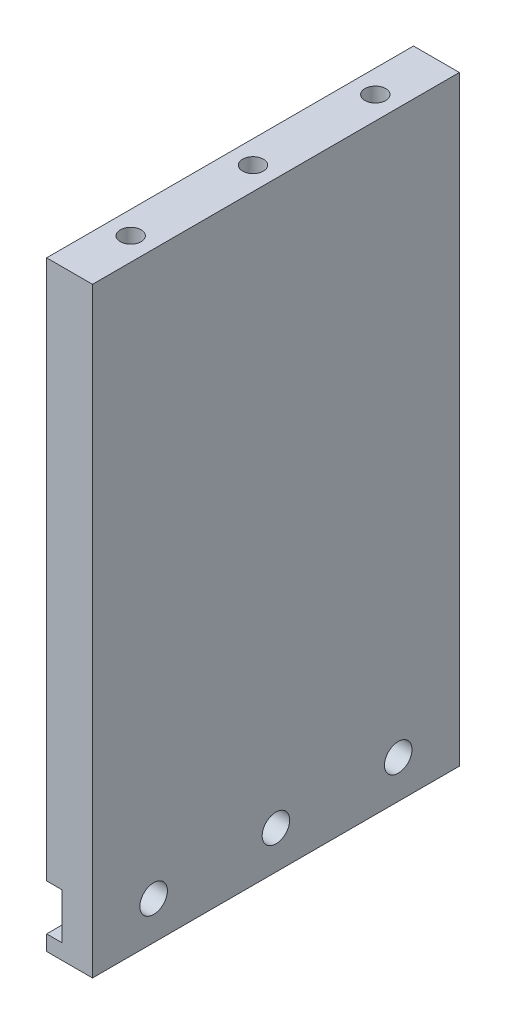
ISO-10303-21;
HEADER;
FILE_DESCRIPTION(('STEP AP214'),'2;1');
FILE_NAME('part.step','',(''),(''),'','','');
FILE_SCHEMA(('AUTOMOTIVE_DESIGN { 1 0 10303 214 1 1 1 1 }'));
ENDSEC;
DATA;
#1=APPLICATION_CONTEXT('core data for automotive mechanical design processes');
#2=APPLICATION_PROTOCOL_DEFINITION('international standard','automotive_design',2000,#1);
#3=PRODUCT_CONTEXT('',#1,'mechanical');
#4=PRODUCT('Part','Part','',(#3));
#5=PRODUCT_RELATED_PRODUCT_CATEGORY('part','',(#4));
#6=PRODUCT_DEFINITION_FORMATION('','',#4);
#7=PRODUCT_DEFINITION_CONTEXT('part definition',#1,'design');
#8=PRODUCT_DEFINITION('design','',#6,#7);
#9=PRODUCT_DEFINITION_SHAPE('','',#8);
#10=(LENGTH_UNIT() NAMED_UNIT(*) SI_UNIT(.MILLI.,.METRE.));
#11=(NAMED_UNIT(*) PLANE_ANGLE_UNIT() SI_UNIT($,.RADIAN.));
#12=(NAMED_UNIT(*) SI_UNIT($,.STERADIAN.) SOLID_ANGLE_UNIT());
#13=UNCERTAINTY_MEASURE_WITH_UNIT(LENGTH_MEASURE(1.E-05),#10,'distance_accuracy_value','');
#14=(GEOMETRIC_REPRESENTATION_CONTEXT(3) GLOBAL_UNCERTAINTY_ASSIGNED_CONTEXT((#13)) GLOBAL_UNIT_ASSIGNED_CONTEXT((#10,
#11,#12)) REPRESENTATION_CONTEXT('',''));
#15=CARTESIAN_POINT('',(0.,0.,0.));
#16=DIRECTION('',(0.,0.,1.));
#17=DIRECTION('',(1.,0.,0.));
#18=AXIS2_PLACEMENT_3D('',#15,#16,#17);
#19=CARTESIAN_POINT('',(-7.50000000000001,95.,60.));
#20=DIRECTION('',(1.,0.,0.));
#21=DIRECTION('',(0.,1.,0.));
#22=AXIS2_PLACEMENT_3D('',#19,#20,#21);
#23=PLANE('',#22);
#24=DIRECTION('',(0.,-1.,0.));
#25=VECTOR('',#24,1.);
#26=CARTESIAN_POINT('',(-7.50000000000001,95.,-60.));
#27=LINE('',#26,#25);
#28=CARTESIAN_POINT('',(-7.50000000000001,95.,-60.));
#29=VERTEX_POINT('',#28);
#30=CARTESIAN_POINT('',(-7.49999999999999,-81.5,-60.));
#31=VERTEX_POINT('',#30);
#32=EDGE_CURVE('E136',#29,#31,#27,.T.);
#33=ORIENTED_EDGE('',*,*,#32,.T.);
#34=DIRECTION('',(0.,0.,-1.));
#35=VECTOR('',#34,1.);
#36=CARTESIAN_POINT('',(-7.49999999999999,-81.5,60.));
#37=LINE('',#36,#35);
#38=CARTESIAN_POINT('',(-7.49999999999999,-81.5,60.));
#39=VERTEX_POINT('',#38);
#40=EDGE_CURVE('E11',#39,#31,#37,.T.);
#41=ORIENTED_EDGE('',*,*,#40,.F.);
#42=DIRECTION('',(0.,-1.,0.));
#43=VECTOR('',#42,1.);
#44=CARTESIAN_POINT('',(-7.50000000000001,95.,60.));
#45=LINE('',#44,#43);
#46=CARTESIAN_POINT('',(-7.50000000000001,95.,60.));
#47=VERTEX_POINT('',#46);
#48=EDGE_CURVE('E151',#47,#39,#45,.T.);
#49=ORIENTED_EDGE('',*,*,#48,.F.);
#50=DIRECTION('',(0.,0.,-1.));
#51=VECTOR('',#50,1.);
#52=CARTESIAN_POINT('',(-7.50000000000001,95.,60.));
#53=LINE('',#52,#51);
#54=EDGE_CURVE('E132',#47,#29,#53,.T.);
#55=ORIENTED_EDGE('',*,*,#54,.T.);
#56=EDGE_LOOP('',(#33,#41,#49,#55));
#57=FACE_BOUND('',#56,.T.);
#58=ADVANCED_FACE('F37',(#57),#23,.F.);
#59=CARTESIAN_POINT('',(-7.49999999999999,-81.5,60.));
#60=DIRECTION('',(0.,1.,0.));
#61=DIRECTION('',(0.,0.,1.));
#62=AXIS2_PLACEMENT_3D('',#59,#60,#61);
#63=PLANE('',#62);
#64=DIRECTION('',(1.,0.,0.));
#65=VECTOR('',#64,1.);
#66=CARTESIAN_POINT('',(-7.49999999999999,-81.5,-60.));
#67=LINE('',#66,#65);
#68=CARTESIAN_POINT('',(-2.49999999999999,-81.5,-60.));
#69=VERTEX_POINT('',#68);
#70=EDGE_CURVE('E139',#31,#69,#67,.T.);
#71=ORIENTED_EDGE('',*,*,#70,.T.);
#72=DIRECTION('',(0.,0.,-1.));
#73=VECTOR('',#72,1.);
#74=CARTESIAN_POINT('',(-2.49999999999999,-81.5,60.));
#75=LINE('',#74,#73);
#76=CARTESIAN_POINT('',(-2.49999999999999,-81.5,60.));
#77=VERTEX_POINT('',#76);
#78=EDGE_CURVE('E45',#77,#69,#75,.T.);
#79=ORIENTED_EDGE('',*,*,#78,.F.);
#80=DIRECTION('',(1.,0.,0.));
#81=VECTOR('',#80,1.);
#82=CARTESIAN_POINT('',(-7.49999999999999,-81.5,60.));
#83=LINE('',#82,#81);
#84=EDGE_CURVE('E97',#39,#77,#83,.T.);
#85=ORIENTED_EDGE('',*,*,#84,.F.);
#86=ORIENTED_EDGE('',*,*,#40,.T.);
#87=EDGE_LOOP('',(#71,#79,#85,#86));
#88=FACE_BOUND('',#87,.T.);
#89=ADVANCED_FACE('F255',(#88),#63,.F.);
#90=CARTESIAN_POINT('',(-2.49999999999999,-81.5,60.));
#91=DIRECTION('',(1.,0.,0.));
#92=DIRECTION('',(0.,1.,0.));
#93=AXIS2_PLACEMENT_3D('',#90,#91,#92);
#94=PLANE('',#93);
#95=CARTESIAN_POINT('',(-2.49999999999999,-89.,0.));
#96=DIRECTION('',(1.,0.,0.));
#97=DIRECTION('',(0.,1.,0.));
#98=AXIS2_PLACEMENT_3D('',#95,#96,#97);
#99=CIRCLE('',#98,4.5);
#100=CARTESIAN_POINT('',(-2.49999999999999,-84.5,0.));
#101=VERTEX_POINT('',#100);
#102=EDGE_CURVE('E195',#101,#101,#99,.T.);
#103=ORIENTED_EDGE('',*,*,#102,.T.);
#104=EDGE_LOOP('',(#103));
#105=FACE_BOUND('',#104,.T.);
#106=CARTESIAN_POINT('',(-2.49999999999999,-89.,-40.));
#107=DIRECTION('',(1.,0.,0.));
#108=DIRECTION('',(0.,1.,0.));
#109=AXIS2_PLACEMENT_3D('',#106,#107,#108);
#110=CIRCLE('',#109,4.49999999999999);
#111=CARTESIAN_POINT('',(-2.49999999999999,-84.5,-40.));
#112=VERTEX_POINT('',#111);
#113=EDGE_CURVE('E189',#112,#112,#110,.T.);
#114=ORIENTED_EDGE('',*,*,#113,.T.);
#115=EDGE_LOOP('',(#114));
#116=FACE_BOUND('',#115,.T.);
#117=CARTESIAN_POINT('',(-2.49999999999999,-89.,40.));
#118=DIRECTION('',(1.,0.,0.));
#119=DIRECTION('',(0.,1.,0.));
#120=AXIS2_PLACEMENT_3D('',#117,#118,#119);
#121=CIRCLE('',#120,4.49999999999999);
#122=CARTESIAN_POINT('',(-2.49999999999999,-84.5,40.));
#123=VERTEX_POINT('',#122);
#124=EDGE_CURVE('E140',#123,#123,#121,.T.);
#125=ORIENTED_EDGE('',*,*,#124,.T.);
#126=EDGE_LOOP('',(#125));
#127=FACE_BOUND('',#126,.T.);
#128=DIRECTION('',(0.,-1.,0.));
#129=VECTOR('',#128,1.);
#130=CARTESIAN_POINT('',(-2.49999999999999,-81.5,-60.));
#131=LINE('',#130,#129);
#132=CARTESIAN_POINT('',(-2.49999999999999,-96.5,-60.));
#133=VERTEX_POINT('',#132);
#134=EDGE_CURVE('E142',#69,#133,#131,.T.);
#135=ORIENTED_EDGE('',*,*,#134,.T.);
#136=DIRECTION('',(0.,0.,-1.));
#137=VECTOR('',#136,1.);
#138=CARTESIAN_POINT('',(-2.49999999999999,-96.5,60.));
#139=LINE('',#138,#137);
#140=CARTESIAN_POINT('',(-2.49999999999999,-96.5,60.));
#141=VERTEX_POINT('',#140);
#142=EDGE_CURVE('E158',#141,#133,#139,.T.);
#143=ORIENTED_EDGE('',*,*,#142,.F.);
#144=DIRECTION('',(0.,-1.,0.));
#145=VECTOR('',#144,1.);
#146=CARTESIAN_POINT('',(-2.49999999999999,-81.5,60.));
#147=LINE('',#146,#145);
#148=EDGE_CURVE('E166',#77,#141,#147,.T.);
#149=ORIENTED_EDGE('',*,*,#148,.F.);
#150=ORIENTED_EDGE('',*,*,#78,.T.);
#151=EDGE_LOOP('',(#135,#143,#149,#150));
#152=FACE_BOUND('',#151,.T.);
#153=ADVANCED_FACE('F164',(#105,#116,#127,#152),#94,.F.);
#154=CARTESIAN_POINT('',(-7.49999999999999,-96.5,60.));
#155=DIRECTION('',(0.,-1.,0.));
#156=DIRECTION('',(0.,0.,-1.));
#157=AXIS2_PLACEMENT_3D('',#154,#155,#156);
#158=PLANE('',#157);
#159=DIRECTION('',(-1.,0.,0.));
#160=VECTOR('',#159,1.);
#161=CARTESIAN_POINT('',(-7.49999999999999,-96.5,-60.));
#162=LINE('',#161,#160);
#163=CARTESIAN_POINT('',(-7.49999999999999,-96.5,-60.));
#164=VERTEX_POINT('',#163);
#165=EDGE_CURVE('E144',#133,#164,#162,.T.);
#166=ORIENTED_EDGE('',*,*,#165,.T.);
#167=DIRECTION('',(0.,0.,-1.));
#168=VECTOR('',#167,1.);
#169=CARTESIAN_POINT('',(-7.49999999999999,-96.5,60.));
#170=LINE('',#169,#168);
#171=CARTESIAN_POINT('',(-7.49999999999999,-96.5,60.));
#172=VERTEX_POINT('',#171);
#173=EDGE_CURVE('E155',#172,#164,#170,.T.);
#174=ORIENTED_EDGE('',*,*,#173,.F.);
#175=DIRECTION('',(-1.,0.,0.));
#176=VECTOR('',#175,1.);
#177=CARTESIAN_POINT('',(-7.49999999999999,-96.5,60.));
#178=LINE('',#177,#176);
#179=EDGE_CURVE('E178',#141,#172,#178,.T.);
#180=ORIENTED_EDGE('',*,*,#179,.F.);
#181=ORIENTED_EDGE('',*,*,#142,.T.);
#182=EDGE_LOOP('',(#166,#174,#180,#181));
#183=FACE_BOUND('',#182,.T.);
#184=ADVANCED_FACE('F174',(#183),#158,.F.);
#185=CARTESIAN_POINT('',(-7.49999999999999,-96.5,60.));
#186=DIRECTION('',(1.,0.,0.));
#187=DIRECTION('',(0.,1.,0.));
#188=AXIS2_PLACEMENT_3D('',#185,#186,#187);
#189=PLANE('',#188);
#190=DIRECTION('',(0.,-1.,0.));
#191=VECTOR('',#190,1.);
#192=CARTESIAN_POINT('',(-7.49999999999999,-96.5,-60.));
#193=LINE('',#192,#191);
#194=CARTESIAN_POINT('',(-7.49999999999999,-101.5,-60.));
#195=VERTEX_POINT('',#194);
#196=EDGE_CURVE('E146',#164,#195,#193,.T.);
#197=ORIENTED_EDGE('',*,*,#196,.T.);
#198=DIRECTION('',(0.,0.,-1.));
#199=VECTOR('',#198,1.);
#200=CARTESIAN_POINT('',(-7.49999999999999,-101.5,60.));
#201=LINE('',#200,#199);
#202=CARTESIAN_POINT('',(-7.49999999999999,-101.5,60.));
#203=VERTEX_POINT('',#202);
#204=EDGE_CURVE('E127',#203,#195,#201,.T.);
#205=ORIENTED_EDGE('',*,*,#204,.F.);
#206=DIRECTION('',(0.,-1.,0.));
#207=VECTOR('',#206,1.);
#208=CARTESIAN_POINT('',(-7.49999999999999,-96.5,60.));
#209=LINE('',#208,#207);
#210=EDGE_CURVE('E118',#172,#203,#209,.T.);
#211=ORIENTED_EDGE('',*,*,#210,.F.);
#212=ORIENTED_EDGE('',*,*,#173,.T.);
#213=EDGE_LOOP('',(#197,#205,#211,#212));
#214=FACE_BOUND('',#213,.T.);
#215=ADVANCED_FACE('F177',(#214),#189,.F.);
#216=CARTESIAN_POINT('',(-7.49999999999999,-101.5,60.));
#217=DIRECTION('',(0.,1.,0.));
#218=DIRECTION('',(0.,0.,1.));
#219=AXIS2_PLACEMENT_3D('',#216,#217,#218);
#220=PLANE('',#219);
#221=DIRECTION('',(1.,0.,0.));
#222=VECTOR('',#221,1.);
#223=CARTESIAN_POINT('',(-7.49999999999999,-101.5,-60.));
#224=LINE('',#223,#222);
#225=CARTESIAN_POINT('',(7.50000000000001,-101.5,-60.));
#226=VERTEX_POINT('',#225);
#227=EDGE_CURVE('E126',#195,#226,#224,.T.);
#228=ORIENTED_EDGE('',*,*,#227,.T.);
#229=DIRECTION('',(0.,0.,-1.));
#230=VECTOR('',#229,1.);
#231=CARTESIAN_POINT('',(7.50000000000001,-101.5,60.));
#232=LINE('',#231,#230);
#233=CARTESIAN_POINT('',(7.50000000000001,-101.5,60.));
#234=VERTEX_POINT('',#233);
#235=EDGE_CURVE('E123',#234,#226,#232,.T.);
#236=ORIENTED_EDGE('',*,*,#235,.F.);
#237=DIRECTION('',(1.,0.,0.));
#238=VECTOR('',#237,1.);
#239=CARTESIAN_POINT('',(-7.49999999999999,-101.5,60.));
#240=LINE('',#239,#238);
#241=EDGE_CURVE('E112',#203,#234,#240,.T.);
#242=ORIENTED_EDGE('',*,*,#241,.F.);
#243=ORIENTED_EDGE('',*,*,#204,.T.);
#244=EDGE_LOOP('',(#228,#236,#242,#243));
#245=FACE_BOUND('',#244,.T.);
#246=ADVANCED_FACE('F124',(#245),#220,.F.);
#247=CARTESIAN_POINT('',(7.49999999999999,95.,60.));
#248=DIRECTION('',(-1.,0.,0.));
#249=DIRECTION('',(0.,-1.,0.));
#250=AXIS2_PLACEMENT_3D('',#247,#248,#249);
#251=PLANE('',#250);
#252=CARTESIAN_POINT('',(7.50000000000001,-89.,0.));
#253=DIRECTION('',(1.,0.,0.));
#254=DIRECTION('',(0.,0.,-1.));
#255=AXIS2_PLACEMENT_3D('',#252,#253,#254);
#256=CIRCLE('',#255,4.49999999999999);
#257=CARTESIAN_POINT('',(7.50000000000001,-89.,-4.49999999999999));
#258=VERTEX_POINT('',#257);
#259=EDGE_CURVE('E198',#258,#258,#256,.T.);
#260=ORIENTED_EDGE('',*,*,#259,.F.);
#261=EDGE_LOOP('',(#260));
#262=FACE_BOUND('',#261,.T.);
#263=CARTESIAN_POINT('',(7.50000000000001,-89.,-40.));
#264=DIRECTION('',(1.,0.,0.));
#265=DIRECTION('',(0.,0.,-1.));
#266=AXIS2_PLACEMENT_3D('',#263,#264,#265);
#267=CIRCLE('',#266,4.49999999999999);
#268=CARTESIAN_POINT('',(7.50000000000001,-89.,-44.5));
#269=VERTEX_POINT('',#268);
#270=EDGE_CURVE('E192',#269,#269,#267,.T.);
#271=ORIENTED_EDGE('',*,*,#270,.F.);
#272=EDGE_LOOP('',(#271));
#273=FACE_BOUND('',#272,.T.);
#274=CARTESIAN_POINT('',(7.50000000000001,-89.,40.));
#275=DIRECTION('',(1.,0.,0.));
#276=DIRECTION('',(0.,0.,-1.));
#277=AXIS2_PLACEMENT_3D('',#274,#275,#276);
#278=CIRCLE('',#277,4.49999999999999);
#279=CARTESIAN_POINT('',(7.50000000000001,-89.,35.5));
#280=VERTEX_POINT('',#279);
#281=EDGE_CURVE('E186',#280,#280,#278,.T.);
#282=ORIENTED_EDGE('',*,*,#281,.F.);
#283=EDGE_LOOP('',(#282));
#284=FACE_BOUND('',#283,.T.);
#285=DIRECTION('',(0.,1.,0.));
#286=VECTOR('',#285,1.);
#287=CARTESIAN_POINT('',(7.49999999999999,95.,-60.));
#288=LINE('',#287,#286);
#289=CARTESIAN_POINT('',(7.49999999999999,95.,-60.));
#290=VERTEX_POINT('',#289);
#291=EDGE_CURVE('E83',#226,#290,#288,.T.);
#292=ORIENTED_EDGE('',*,*,#291,.T.);
#293=DIRECTION('',(0.,0.,-1.));
#294=VECTOR('',#293,1.);
#295=CARTESIAN_POINT('',(7.49999999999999,95.,60.));
#296=LINE('',#295,#294);
#297=CARTESIAN_POINT('',(7.49999999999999,95.,60.));
#298=VERTEX_POINT('',#297);
#299=EDGE_CURVE('E128',#298,#290,#296,.T.);
#300=ORIENTED_EDGE('',*,*,#299,.F.);
#301=DIRECTION('',(0.,1.,0.));
#302=VECTOR('',#301,1.);
#303=CARTESIAN_POINT('',(7.49999999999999,95.,60.));
#304=LINE('',#303,#302);
#305=EDGE_CURVE('E116',#234,#298,#304,.T.);
#306=ORIENTED_EDGE('',*,*,#305,.F.);
#307=ORIENTED_EDGE('',*,*,#235,.T.);
#308=EDGE_LOOP('',(#292,#300,#306,#307));
#309=FACE_BOUND('',#308,.T.);
#310=ADVANCED_FACE('F130',(#262,#273,#284,#309),#251,.F.);
#311=CARTESIAN_POINT('',(-7.50000000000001,95.,60.));
#312=DIRECTION('',(0.,-1.,0.));
#313=DIRECTION('',(0.,0.,-1.));
#314=AXIS2_PLACEMENT_3D('',#311,#312,#313);
#315=PLANE('',#314);
#316=CARTESIAN_POINT('',(0.,95.,0.));
#317=DIRECTION('',(0.,1.,0.));
#318=DIRECTION('',(0.,0.,1.));
#319=AXIS2_PLACEMENT_3D('',#316,#317,#318);
#320=CIRCLE('',#319,3.39999999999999);
#321=CARTESIAN_POINT('',(0.,95.,3.39999999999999));
#322=VERTEX_POINT('',#321);
#323=EDGE_CURVE('E213',#322,#322,#320,.T.);
#324=ORIENTED_EDGE('',*,*,#323,.F.);
#325=EDGE_LOOP('',(#324));
#326=FACE_BOUND('',#325,.T.);
#327=CARTESIAN_POINT('',(0.,95.,40.));
#328=DIRECTION('',(0.,1.,0.));
#329=DIRECTION('',(0.,0.,1.));
#330=AXIS2_PLACEMENT_3D('',#327,#328,#329);
#331=CIRCLE('',#330,3.39999999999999);
#332=CARTESIAN_POINT('',(0.,95.,43.4));
#333=VERTEX_POINT('',#332);
#334=EDGE_CURVE('E207',#333,#333,#331,.T.);
#335=ORIENTED_EDGE('',*,*,#334,.F.);
#336=EDGE_LOOP('',(#335));
#337=FACE_BOUND('',#336,.T.);
#338=CARTESIAN_POINT('',(0.,95.,-40.));
#339=DIRECTION('',(0.,1.,0.));
#340=DIRECTION('',(0.,0.,1.));
#341=AXIS2_PLACEMENT_3D('',#338,#339,#340);
#342=CIRCLE('',#341,3.39999999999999);
#343=CARTESIAN_POINT('',(0.,95.,-36.6));
#344=VERTEX_POINT('',#343);
#345=EDGE_CURVE('E201',#344,#344,#342,.T.);
#346=ORIENTED_EDGE('',*,*,#345,.F.);
#347=EDGE_LOOP('',(#346));
#348=FACE_BOUND('',#347,.T.);
#349=DIRECTION('',(-1.,0.,0.));
#350=VECTOR('',#349,1.);
#351=CARTESIAN_POINT('',(-7.50000000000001,95.,-60.));
#352=LINE('',#351,#350);
#353=EDGE_CURVE('E89',#290,#29,#352,.T.);
#354=ORIENTED_EDGE('',*,*,#353,.T.);
#355=ORIENTED_EDGE('',*,*,#54,.F.);
#356=DIRECTION('',(-1.,0.,0.));
#357=VECTOR('',#356,1.);
#358=CARTESIAN_POINT('',(-7.50000000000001,95.,60.));
#359=LINE('',#358,#357);
#360=EDGE_CURVE('E53',#298,#47,#359,.T.);
#361=ORIENTED_EDGE('',*,*,#360,.F.);
#362=ORIENTED_EDGE('',*,*,#299,.T.);
#363=EDGE_LOOP('',(#354,#355,#361,#362));
#364=FACE_BOUND('',#363,.T.);
#365=ADVANCED_FACE('F229',(#326,#337,#348,#364),#315,.F.);
#366=CARTESIAN_POINT('',(-7.49999999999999,-81.5,60.));
#367=DIRECTION('',(0.,0.,1.));
#368=DIRECTION('',(1.,0.,0.));
#369=AXIS2_PLACEMENT_3D('',#366,#367,#368);
#370=PLANE('',#369);
#371=ORIENTED_EDGE('',*,*,#48,.T.);
#372=ORIENTED_EDGE('',*,*,#84,.T.);
#373=ORIENTED_EDGE('',*,*,#148,.T.);
#374=ORIENTED_EDGE('',*,*,#179,.T.);
#375=ORIENTED_EDGE('',*,*,#210,.T.);
#376=ORIENTED_EDGE('',*,*,#241,.T.);
#377=ORIENTED_EDGE('',*,*,#305,.T.);
#378=ORIENTED_EDGE('',*,*,#360,.T.);
#379=EDGE_LOOP('',(#371,#372,#373,#374,#375,#376,#377,#378));
#380=FACE_BOUND('',#379,.T.);
#381=ADVANCED_FACE('F114',(#380),#370,.T.);
#382=CARTESIAN_POINT('',(-7.49999999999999,-81.5,-60.));
#383=DIRECTION('',(0.,0.,1.));
#384=DIRECTION('',(1.,0.,0.));
#385=AXIS2_PLACEMENT_3D('',#382,#383,#384);
#386=PLANE('',#385);
#387=ORIENTED_EDGE('',*,*,#32,.F.);
#388=ORIENTED_EDGE('',*,*,#353,.F.);
#389=ORIENTED_EDGE('',*,*,#291,.F.);
#390=ORIENTED_EDGE('',*,*,#227,.F.);
#391=ORIENTED_EDGE('',*,*,#196,.F.);
#392=ORIENTED_EDGE('',*,*,#165,.F.);
#393=ORIENTED_EDGE('',*,*,#134,.F.);
#394=ORIENTED_EDGE('',*,*,#70,.F.);
#395=EDGE_LOOP('',(#387,#388,#389,#390,#391,#392,#393,#394));
#396=FACE_BOUND('',#395,.T.);
#397=ADVANCED_FACE('F170',(#396),#386,.F.);
#398=CARTESIAN_POINT('',(7.50000000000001,-89.,40.));
#399=DIRECTION('',(1.,0.,0.));
#400=DIRECTION('',(0.,0.,-1.));
#401=AXIS2_PLACEMENT_3D('',#398,#399,#400);
#402=CYLINDRICAL_SURFACE('',#401,4.49999999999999);
#403=ORIENTED_EDGE('',*,*,#281,.T.);
#404=EDGE_LOOP('',(#403));
#405=FACE_BOUND('',#404,.T.);
#406=ORIENTED_EDGE('',*,*,#124,.F.);
#407=EDGE_LOOP('',(#406));
#408=FACE_BOUND('',#407,.T.);
#409=ADVANCED_FACE('F279',(#405,#408),#402,.F.);
#410=CARTESIAN_POINT('',(7.50000000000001,-89.,-40.));
#411=DIRECTION('',(1.,0.,0.));
#412=DIRECTION('',(0.,0.,-1.));
#413=AXIS2_PLACEMENT_3D('',#410,#411,#412);
#414=CYLINDRICAL_SURFACE('',#413,4.49999999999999);
#415=ORIENTED_EDGE('',*,*,#270,.T.);
#416=EDGE_LOOP('',(#415));
#417=FACE_BOUND('',#416,.T.);
#418=ORIENTED_EDGE('',*,*,#113,.F.);
#419=EDGE_LOOP('',(#418));
#420=FACE_BOUND('',#419,.T.);
#421=ADVANCED_FACE('F250',(#417,#420),#414,.F.);
#422=CARTESIAN_POINT('',(7.50000000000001,-89.,0.));
#423=DIRECTION('',(1.,0.,0.));
#424=DIRECTION('',(0.,0.,-1.));
#425=AXIS2_PLACEMENT_3D('',#422,#423,#424);
#426=CYLINDRICAL_SURFACE('',#425,4.5);
#427=ORIENTED_EDGE('',*,*,#259,.T.);
#428=EDGE_LOOP('',(#427));
#429=FACE_BOUND('',#428,.T.);
#430=ORIENTED_EDGE('',*,*,#102,.F.);
#431=EDGE_LOOP('',(#430));
#432=FACE_BOUND('',#431,.T.);
#433=ADVANCED_FACE('F240',(#429,#432),#426,.F.);
#434=CARTESIAN_POINT('',(0.,95.,-40.));
#435=DIRECTION('',(0.,1.,0.));
#436=DIRECTION('',(0.,0.,1.));
#437=AXIS2_PLACEMENT_3D('',#434,#435,#436);
#438=CYLINDRICAL_SURFACE('',#437,3.39999999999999);
#439=CARTESIAN_POINT('',(0.,72.75,-40.));
#440=DIRECTION('',(0.,1.,0.));
#441=DIRECTION('',(0.,0.,1.));
#442=AXIS2_PLACEMENT_3D('',#439,#440,#441);
#443=CIRCLE('',#442,3.39999999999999);
#444=CARTESIAN_POINT('',(0.,72.75,-36.6));
#445=VERTEX_POINT('',#444);
#446=EDGE_CURVE('E204',#445,#445,#443,.T.);
#447=ORIENTED_EDGE('',*,*,#446,.F.);
#448=EDGE_LOOP('',(#447));
#449=FACE_BOUND('',#448,.T.);
#450=ORIENTED_EDGE('',*,*,#345,.T.);
#451=EDGE_LOOP('',(#450));
#452=FACE_BOUND('',#451,.T.);
#453=ADVANCED_FACE('F237',(#449,#452),#438,.F.);
#454=CARTESIAN_POINT('',(0.,72.75,-40.));
#455=DIRECTION('',(0.,1.,0.));
#456=DIRECTION('',(0.,0.,1.));
#457=AXIS2_PLACEMENT_3D('',#454,#455,#456);
#458=CONICAL_SURFACE('',#457,3.39999999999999,1.02974425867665);
#459=CARTESIAN_POINT('',(0.,70.7070738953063,-40.));
#460=VERTEX_POINT('',#459);
#461=VERTEX_LOOP('',#460);
#462=FACE_BOUND('',#461,.T.);
#463=ORIENTED_EDGE('',*,*,#446,.T.);
#464=EDGE_LOOP('',(#463));
#465=FACE_BOUND('',#464,.T.);
#466=ADVANCED_FACE('F239',(#462,#465),#458,.F.);
#467=CARTESIAN_POINT('',(0.,95.,40.));
#468=DIRECTION('',(0.,1.,0.));
#469=DIRECTION('',(0.,0.,1.));
#470=AXIS2_PLACEMENT_3D('',#467,#468,#469);
#471=CYLINDRICAL_SURFACE('',#470,3.39999999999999);
#472=CARTESIAN_POINT('',(0.,72.75,40.));
#473=DIRECTION('',(0.,1.,0.));
#474=DIRECTION('',(0.,0.,1.));
#475=AXIS2_PLACEMENT_3D('',#472,#473,#474);
#476=CIRCLE('',#475,3.39999999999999);
#477=CARTESIAN_POINT('',(0.,72.75,43.4));
#478=VERTEX_POINT('',#477);
#479=EDGE_CURVE('E210',#478,#478,#476,.T.);
#480=ORIENTED_EDGE('',*,*,#479,.F.);
#481=EDGE_LOOP('',(#480));
#482=FACE_BOUND('',#481,.T.);
#483=ORIENTED_EDGE('',*,*,#334,.T.);
#484=EDGE_LOOP('',(#483));
#485=FACE_BOUND('',#484,.T.);
#486=ADVANCED_FACE('F247',(#482,#485),#471,.F.);
#487=CARTESIAN_POINT('',(0.,72.75,40.));
#488=DIRECTION('',(0.,1.,0.));
#489=DIRECTION('',(0.,0.,1.));
#490=AXIS2_PLACEMENT_3D('',#487,#488,#489);
#491=CONICAL_SURFACE('',#490,3.39999999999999,1.02974425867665);
#492=CARTESIAN_POINT('',(0.,70.7070738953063,40.));
#493=VERTEX_POINT('',#492);
#494=VERTEX_LOOP('',#493);
#495=FACE_BOUND('',#494,.T.);
#496=ORIENTED_EDGE('',*,*,#479,.T.);
#497=EDGE_LOOP('',(#496));
#498=FACE_BOUND('',#497,.T.);
#499=ADVANCED_FACE('F225',(#495,#498),#491,.F.);
#500=CARTESIAN_POINT('',(0.,95.,0.));
#501=DIRECTION('',(0.,1.,0.));
#502=DIRECTION('',(0.,0.,1.));
#503=AXIS2_PLACEMENT_3D('',#500,#501,#502);
#504=CYLINDRICAL_SURFACE('',#503,3.39999999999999);
#505=CARTESIAN_POINT('',(0.,72.75,0.));
#506=DIRECTION('',(0.,1.,0.));
#507=DIRECTION('',(0.,0.,1.));
#508=AXIS2_PLACEMENT_3D('',#505,#506,#507);
#509=CIRCLE('',#508,3.39999999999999);
#510=CARTESIAN_POINT('',(0.,72.75,3.39999999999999));
#511=VERTEX_POINT('',#510);
#512=EDGE_CURVE('E216',#511,#511,#509,.T.);
#513=ORIENTED_EDGE('',*,*,#512,.F.);
#514=EDGE_LOOP('',(#513));
#515=FACE_BOUND('',#514,.T.);
#516=ORIENTED_EDGE('',*,*,#323,.T.);
#517=EDGE_LOOP('',(#516));
#518=FACE_BOUND('',#517,.T.);
#519=ADVANCED_FACE('F222',(#515,#518),#504,.F.);
#520=CARTESIAN_POINT('',(0.,72.75,0.));
#521=DIRECTION('',(0.,1.,0.));
#522=DIRECTION('',(0.,0.,1.));
#523=AXIS2_PLACEMENT_3D('',#520,#521,#522);
#524=CONICAL_SURFACE('',#523,3.39999999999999,1.02974425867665);
#525=CARTESIAN_POINT('',(0.,70.7070738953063,0.));
#526=VERTEX_POINT('',#525);
#527=VERTEX_LOOP('',#526);
#528=FACE_BOUND('',#527,.T.);
#529=ORIENTED_EDGE('',*,*,#512,.T.);
#530=EDGE_LOOP('',(#529));
#531=FACE_BOUND('',#530,.T.);
#532=ADVANCED_FACE('F220',(#528,#531),#524,.F.);
#533=CLOSED_SHELL('',(#58,#89,#153,#184,#215,#246,#310,#365,#381,#397,#409,#421,#433,#453,#466,
#486,#499,#519,#532));
#534=MANIFOLD_SOLID_BREP('B2',#533);
#535=ADVANCED_BREP_SHAPE_REPRESENTATION('',(#18,#534),#14);
#536=SHAPE_DEFINITION_REPRESENTATION(#9,#535);
ENDSEC;
END-ISO-10303-21;
